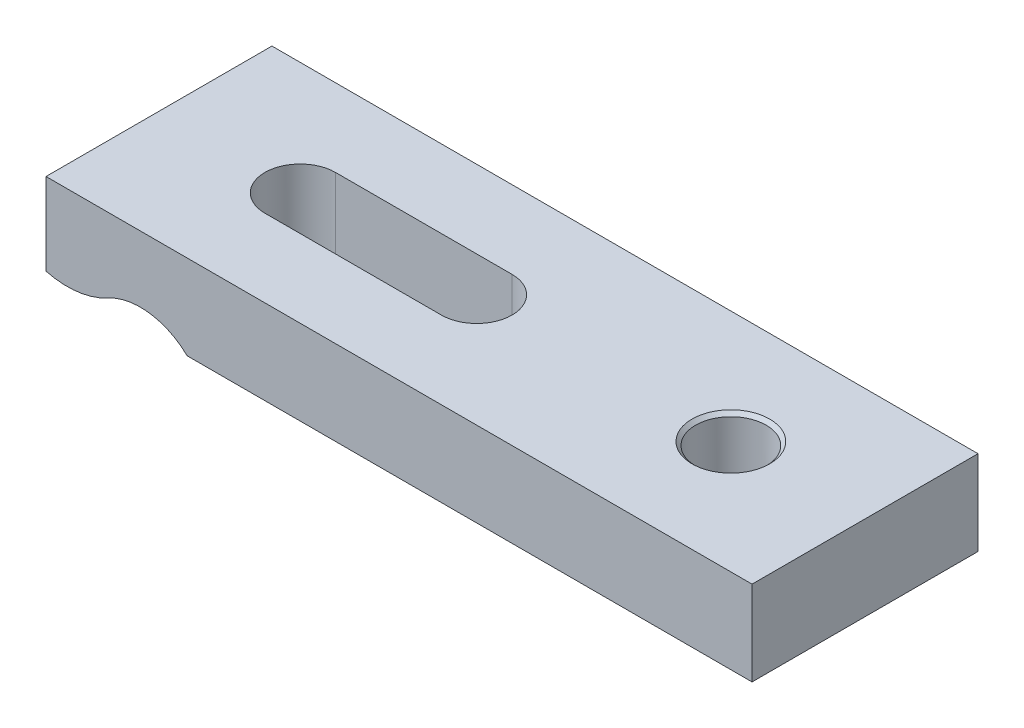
from build123d import *

# Parameters (mm, degrees)
BASE_EXTRUSION_DEPTH    = 32
ENL_V_MAT_EXTRU_1_DEPTH = 106.678758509
ESQUISSE3_R             = 5
ENL_V_MAT_EXTRU_2_DEPTH = 12
CHANFREIN3_SIZE         = 0.5


with BuildPart() as part:
    # Esquisse1 → Base-Extrusion (new body)
    with BuildSketch(Plane.XY):
        with BuildLine():
            Line((0, 0), (100, 0))
            Line((100, 0), (100, -12))
            Line((100, -12), (19.996369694, -12))
            ThreePointArc((19.996369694, -12), (14.619647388, -9.428865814), (8.761701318, -10.526290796))
            ThreePointArc((8.761701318, -10.526290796), (4.484999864, -11.907761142), (0, -11.618950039))
            Line((0, -11.618950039), (0, 0))
        make_face()
    extrude(amount=BASE_EXTRUSION_DEPTH)

    # Esquisse2 → Enl_v. mat.-Extru.1 (cut, through all)
    with BuildSketch(Plane(origin=(0, 0, 0), x_dir=(1, 0, 0), z_dir=(0, 1, 0))):
        with BuildLine():
            Line((20, -11), (45, -11))
            ThreePointArc((45, -11), (50, -16), (45, -21))
            Line((45, -21), (20, -21))
            ThreePointArc((20, -21), (15, -16), (20, -11))
        make_face()
    extrude(amount=-ENL_V_MAT_EXTRU_1_DEPTH, mode=Mode.SUBTRACT)

    # Esquisse3 → Enl_v. mat.-Extru.2 (cut)
    with BuildSketch(Plane(origin=(0, 0, 0), x_dir=(1, 0, 0), z_dir=(0, 1, 0))):
        with Locations(Location((81, -16, 0), (0, 0, 270))):
            Circle(ESQUISSE3_R)
    extrude(amount=-ENL_V_MAT_EXTRU_2_DEPTH, mode=Mode.SUBTRACT)

    # Chanfrein3
    chanfrein3_edges = [part.edges().sort_by_distance(p)[0] for p in [
        (81, -12, 11),
        (81, 0, 11),
    ]]
    chamfer(chanfrein3_edges, length=CHANFREIN3_SIZE)


solid = part.part
